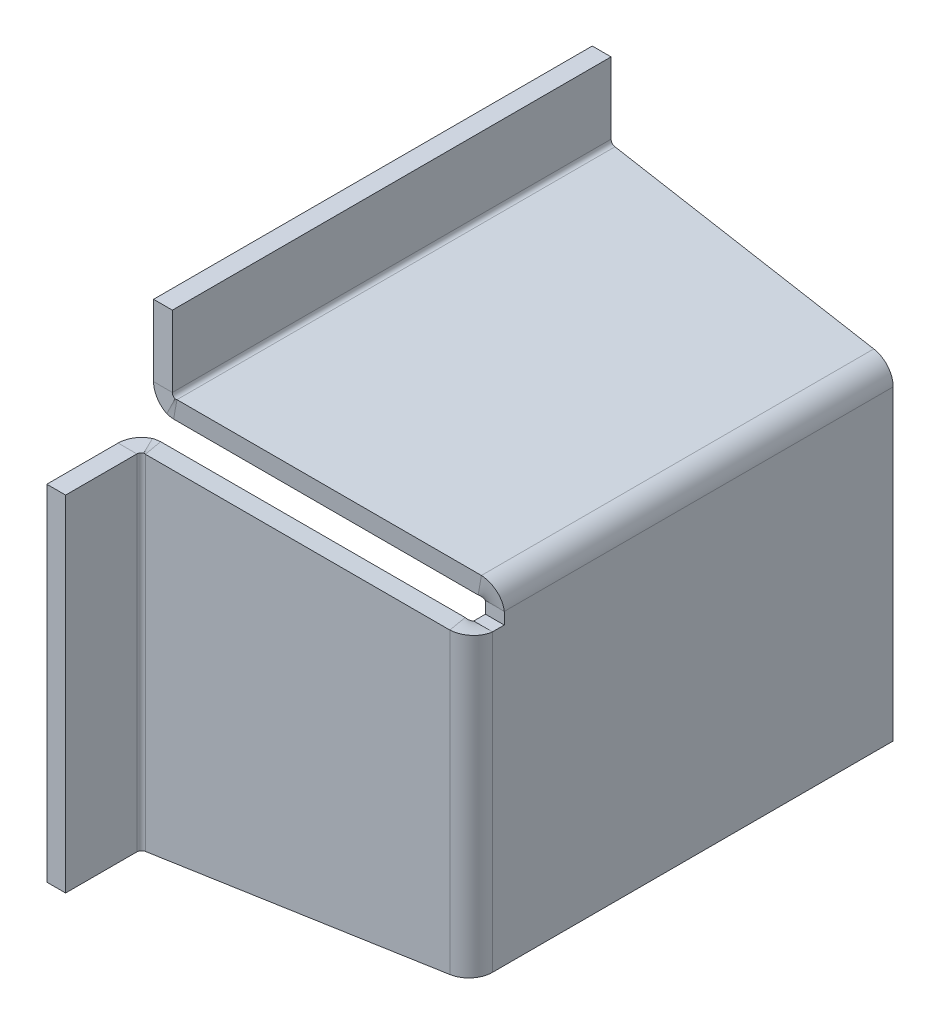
ISO-10303-21;
HEADER;
FILE_DESCRIPTION(('STEP AP214'),'2;1');
FILE_NAME('part.step','',(''),(''),'','','');
FILE_SCHEMA(('AUTOMOTIVE_DESIGN { 1 0 10303 214 1 1 1 1 }'));
ENDSEC;
DATA;
#1=APPLICATION_CONTEXT('core data for automotive mechanical design processes');
#2=APPLICATION_PROTOCOL_DEFINITION('international standard','automotive_design',2000,#1);
#3=PRODUCT_CONTEXT('',#1,'mechanical');
#4=PRODUCT('Part','Part','',(#3));
#5=PRODUCT_RELATED_PRODUCT_CATEGORY('part','',(#4));
#6=PRODUCT_DEFINITION_FORMATION('','',#4);
#7=PRODUCT_DEFINITION_CONTEXT('part definition',#1,'design');
#8=PRODUCT_DEFINITION('design','',#6,#7);
#9=PRODUCT_DEFINITION_SHAPE('','',#8);
#10=(LENGTH_UNIT() NAMED_UNIT(*) SI_UNIT(.MILLI.,.METRE.));
#11=(NAMED_UNIT(*) PLANE_ANGLE_UNIT() SI_UNIT($,.RADIAN.));
#12=(NAMED_UNIT(*) SI_UNIT($,.STERADIAN.) SOLID_ANGLE_UNIT());
#13=UNCERTAINTY_MEASURE_WITH_UNIT(LENGTH_MEASURE(1.E-05),#10,'distance_accuracy_value','');
#14=(GEOMETRIC_REPRESENTATION_CONTEXT(3) GLOBAL_UNCERTAINTY_ASSIGNED_CONTEXT((#13)) GLOBAL_UNIT_ASSIGNED_CONTEXT((#10,
#11,#12)) REPRESENTATION_CONTEXT('',''));
#15=CARTESIAN_POINT('',(0.,0.,0.));
#16=DIRECTION('',(0.,0.,1.));
#17=DIRECTION('',(1.,0.,0.));
#18=AXIS2_PLACEMENT_3D('',#15,#16,#17);
#19=CARTESIAN_POINT('',(925.185297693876,480.,580.));
#20=DIRECTION('',(0.,1.,0.));
#21=DIRECTION('',(0.,0.,1.));
#22=AXIS2_PLACEMENT_3D('',#19,#20,#21);
#23=PLANE('',#22);
#24=DIRECTION('',(0.,0.,-1.));
#25=VECTOR('',#24,1.);
#26=CARTESIAN_POINT('',(-20.0000000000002,480.,580.));
#27=LINE('',#26,#25);
#28=CARTESIAN_POINT('',(-20.0000000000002,480.,466.47346038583));
#29=VERTEX_POINT('',#28);
#30=CARTESIAN_POINT('',(-20.0000000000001,480.,0.));
#31=VERTEX_POINT('',#30);
#32=EDGE_CURVE('E755',#29,#31,#27,.T.);
#33=ORIENTED_EDGE('',*,*,#32,.F.);
#34=DIRECTION('',(-1.,0.,0.));
#35=VECTOR('',#34,1.);
#36=CARTESIAN_POINT('',(925.185297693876,480.,466.473460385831));
#37=LINE('',#36,#35);
#38=CARTESIAN_POINT('',(-2.22044604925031E-13,480.,466.47346038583));
#39=VERTEX_POINT('',#38);
#40=EDGE_CURVE('E42',#39,#29,#37,.T.);
#41=ORIENTED_EDGE('',*,*,#40,.F.);
#42=DIRECTION('',(0.,0.,-1.));
#43=VECTOR('',#42,1.);
#44=CARTESIAN_POINT('',(-2.22044604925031E-13,480.,580.));
#45=LINE('',#44,#43);
#46=CARTESIAN_POINT('',(-1.11022302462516E-13,480.,0.));
#47=VERTEX_POINT('',#46);
#48=EDGE_CURVE('E50',#39,#47,#45,.T.);
#49=ORIENTED_EDGE('',*,*,#48,.T.);
#50=DIRECTION('',(-1.,0.,0.));
#51=VECTOR('',#50,1.);
#52=CARTESIAN_POINT('',(925.185297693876,480.,1.91402472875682E-13));
#53=LINE('',#52,#51);
#54=EDGE_CURVE('E767',#47,#31,#53,.T.);
#55=ORIENTED_EDGE('',*,*,#54,.T.);
#56=EDGE_LOOP('',(#33,#41,#49,#55));
#57=FACE_BOUND('',#56,.T.);
#58=ADVANCED_FACE('F32',(#57),#23,.T.);
#59=CARTESIAN_POINT('',(925.185297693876,-480.,3.03369937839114E-13));
#60=DIRECTION('',(0.,0.,1.));
#61=DIRECTION('',(1.,0.,0.));
#62=AXIS2_PLACEMENT_3D('',#59,#60,#61);
#63=PLANE('',#62);
#64=DIRECTION('',(-1.,0.,0.));
#65=VECTOR('',#64,1.);
#66=CARTESIAN_POINT('',(925.185297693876,404.195498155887,2.0024376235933E-13));
#67=LINE('',#66,#65);
#68=CARTESIAN_POINT('',(0.,404.195498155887,-1.12212319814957E-13));
#69=VERTEX_POINT('',#68);
#70=CARTESIAN_POINT('',(-19.9999999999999,404.195498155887,-1.16972389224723E-13));
#71=VERTEX_POINT('',#70);
#72=EDGE_CURVE('E765',#69,#71,#67,.T.);
#73=ORIENTED_EDGE('',*,*,#72,.T.);
#74=DIRECTION('',(0.,-1.,0.));
#75=VECTOR('',#74,1.);
#76=CARTESIAN_POINT('',(-20.,0.,0.));
#77=LINE('',#76,#75);
#78=EDGE_CURVE('E73',#31,#71,#77,.T.);
#79=ORIENTED_EDGE('',*,*,#78,.F.);
#80=ORIENTED_EDGE('',*,*,#54,.F.);
#81=DIRECTION('',(0.,1.,0.));
#82=VECTOR('',#81,1.);
#83=CARTESIAN_POINT('',(1.66533453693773E-13,-480.,-1.30383812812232E-13));
#84=LINE('',#83,#82);
#85=EDGE_CURVE('E12',#69,#47,#84,.T.);
#86=ORIENTED_EDGE('',*,*,#85,.F.);
#87=EDGE_LOOP('',(#73,#79,#80,#86));
#88=FACE_BOUND('',#87,.T.);
#89=ADVANCED_FACE('F782',(#88),#63,.F.);
#90=CARTESIAN_POINT('',(-19.9999999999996,-480.,-580.));
#91=DIRECTION('',(1.,0.,0.));
#92=DIRECTION('',(0.,0.,-1.));
#93=AXIS2_PLACEMENT_3D('',#90,#91,#92);
#94=PLANE('',#93);
#95=ORIENTED_EDGE('',*,*,#78,.T.);
#96=DIRECTION('',(0.,0.,1.));
#97=VECTOR('',#96,1.);
#98=CARTESIAN_POINT('',(-20.,404.195498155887,-1.29464265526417E-13));
#99=LINE('',#98,#97);
#100=CARTESIAN_POINT('',(-20.0000000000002,404.195498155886,466.47346038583));
#101=VERTEX_POINT('',#100);
#102=EDGE_CURVE('E761',#71,#101,#99,.T.);
#103=ORIENTED_EDGE('',*,*,#102,.T.);
#104=DIRECTION('',(0.,1.,0.));
#105=VECTOR('',#104,1.);
#106=CARTESIAN_POINT('',(-19.9999999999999,-480.,466.47346038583));
#107=LINE('',#106,#105);
#108=EDGE_CURVE('E758',#101,#29,#107,.T.);
#109=ORIENTED_EDGE('',*,*,#108,.T.);
#110=ORIENTED_EDGE('',*,*,#32,.T.);
#111=EDGE_LOOP('',(#95,#103,#109,#110));
#112=FACE_BOUND('',#111,.T.);
#113=ADVANCED_FACE('F774',(#112),#94,.F.);
#114=CARTESIAN_POINT('',(925.185297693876,-480.,466.473460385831));
#115=DIRECTION('',(0.,0.,1.));
#116=DIRECTION('',(1.,0.,0.));
#117=AXIS2_PLACEMENT_3D('',#114,#115,#116);
#118=PLANE('',#117);
#119=ORIENTED_EDGE('',*,*,#108,.F.);
#120=DIRECTION('',(-1.,0.,0.));
#121=VECTOR('',#120,1.);
#122=CARTESIAN_POINT('',(925.185297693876,404.195498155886,466.473460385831));
#123=LINE('',#122,#121);
#124=CARTESIAN_POINT('',(0.,404.195498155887,466.47346038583));
#125=VERTEX_POINT('',#124);
#126=EDGE_CURVE('E769',#125,#101,#123,.T.);
#127=ORIENTED_EDGE('',*,*,#126,.F.);
#128=DIRECTION('',(0.,1.,0.));
#129=VECTOR('',#128,1.);
#130=CARTESIAN_POINT('',(0.,-480.,466.47346038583));
#131=LINE('',#130,#129);
#132=EDGE_CURVE('E753',#125,#39,#131,.T.);
#133=ORIENTED_EDGE('',*,*,#132,.T.);
#134=ORIENTED_EDGE('',*,*,#40,.T.);
#135=EDGE_LOOP('',(#119,#127,#133,#134));
#136=FACE_BOUND('',#135,.T.);
#137=ADVANCED_FACE('F777',(#136),#118,.T.);
#138=CARTESIAN_POINT('',(3.33066907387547E-13,-480.,-580.));
#139=DIRECTION('',(1.,0.,0.));
#140=DIRECTION('',(0.,0.,-1.));
#141=AXIS2_PLACEMENT_3D('',#138,#139,#140);
#142=PLANE('',#141);
#143=DIRECTION('',(0.,0.,1.));
#144=VECTOR('',#143,1.);
#145=CARTESIAN_POINT('',(0.,404.195498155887,-1.22487685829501E-13));
#146=LINE('',#145,#144);
#147=EDGE_CURVE('E36',#69,#125,#146,.T.);
#148=ORIENTED_EDGE('',*,*,#147,.F.);
#149=ORIENTED_EDGE('',*,*,#85,.T.);
#150=ORIENTED_EDGE('',*,*,#48,.F.);
#151=ORIENTED_EDGE('',*,*,#132,.F.);
#152=EDGE_LOOP('',(#148,#149,#150,#151));
#153=FACE_BOUND('',#152,.T.);
#154=ADVANCED_FACE('F34',(#153),#142,.T.);
#155=CARTESIAN_POINT('',(-197.673013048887,-688.514182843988,467.454817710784));
#156=DIRECTION('',(0.168488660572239,-0.0297090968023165,0.985255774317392));
#157=DIRECTION('',(0.970287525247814,-0.171087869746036,-0.171087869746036));
#158=AXIS2_PLACEMENT_3D('',#155,#156,#157);
#159=PLANE('',#158);
#160=DIRECTION('',(-0.970287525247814,0.171087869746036,0.171087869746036));
#161=VECTOR('',#160,1.);
#162=CARTESIAN_POINT('',(-5.56555395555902,400.981357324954,467.454817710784));
#163=LINE('',#162,#161);
#164=CARTESIAN_POINT('',(4.13175911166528,399.271459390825,465.744919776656));
#165=VERTEX_POINT('',#164);
#166=CARTESIAN_POINT('',(279.341204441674,350.744608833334,417.218069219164));
#167=VERTEX_POINT('',#166);
#168=EDGE_CURVE('E710',#165,#167,#163,.F.);
#169=ORIENTED_EDGE('',*,*,#168,.F.);
#170=CARTESIAN_POINT('',(0.658795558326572,379.575304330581,465.744919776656));
#171=CARTESIAN_POINT('',(4.13175911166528,399.271459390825,465.744919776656));
#172=B_SPLINE_CURVE_WITH_KNOTS('',1,(#170,#171),.UNSPECIFIED.,.F.,.F.,(2,2),(0.,1.),.UNSPECIFIED.);
#173=CARTESIAN_POINT('',(0.658795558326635,379.575304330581,465.744919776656));
#174=VERTEX_POINT('',#173);
#175=EDGE_CURVE('E222',#174,#165,#172,.T.);
#176=ORIENTED_EDGE('',*,*,#175,.F.);
#177=DIRECTION('',(-0.970287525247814,0.171087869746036,0.171087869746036));
#178=VECTOR('',#177,1.);
#179=CARTESIAN_POINT('',(-9.03851750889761,381.28520226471,467.454817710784));
#180=LINE('',#179,#178);
#181=CARTESIAN_POINT('',(275.868240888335,331.04845377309,417.218069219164));
#182=VERTEX_POINT('',#181);
#183=EDGE_CURVE('E733',#174,#182,#180,.F.);
#184=ORIENTED_EDGE('',*,*,#183,.T.);
#185=CARTESIAN_POINT('',(279.341204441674,350.744608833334,417.218069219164));
#186=CARTESIAN_POINT('',(275.868240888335,331.04845377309,417.218069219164));
#187=B_SPLINE_CURVE_WITH_KNOTS('',1,(#185,#186),.UNSPECIFIED.,.F.,.F.,(2,2),(0.,1.),.UNSPECIFIED.);
#188=EDGE_CURVE('E349',#182,#167,#187,.F.);
#189=ORIENTED_EDGE('',*,*,#188,.T.);
#190=EDGE_LOOP('',(#169,#176,#184,#189));
#191=FACE_BOUND('',#190,.T.);
#192=ADVANCED_FACE('F671',(#191),#159,.T.);
#193=CARTESIAN_POINT('',(-2.22044604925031E-13,400.,500.));
#194=DIRECTION('',(0.173648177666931,0.984807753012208,0.));
#195=DIRECTION('',(-0.984807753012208,0.173648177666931,0.));
#196=AXIS2_PLACEMENT_3D('',#193,#194,#195);
#197=PLANE('',#196);
#198=DIRECTION('',(-0.984807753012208,0.173648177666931,0.));
#199=VECTOR('',#198,1.);
#200=CARTESIAN_POINT('',(0.,400.,-1.20237744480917E-13));
#201=LINE('',#200,#199);
#202=CARTESIAN_POINT('',(4.13175911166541,399.271459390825,-1.1876503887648E-13));
#203=VERTEX_POINT('',#202);
#204=CARTESIAN_POINT('',(279.341204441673,350.744608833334,-1.31692926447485E-13));
#205=VERTEX_POINT('',#204);
#206=EDGE_CURVE('E697',#203,#205,#201,.F.);
#207=ORIENTED_EDGE('',*,*,#206,.F.);
#208=DIRECTION('',(0.,0.,-1.));
#209=VECTOR('',#208,1.);
#210=CARTESIAN_POINT('',(4.13175911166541,399.271459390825,-1.1876503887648E-13));
#211=LINE('',#210,#209);
#212=EDGE_CURVE('E715',#203,#165,#211,.F.);
#213=ORIENTED_EDGE('',*,*,#212,.T.);
#214=ORIENTED_EDGE('',*,*,#168,.T.);
#215=DIRECTION('',(0.,0.,1.));
#216=VECTOR('',#215,1.);
#217=CARTESIAN_POINT('',(279.341204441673,350.744608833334,417.218069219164));
#218=LINE('',#217,#216);
#219=EDGE_CURVE('E703',#167,#205,#218,.F.);
#220=ORIENTED_EDGE('',*,*,#219,.T.);
#221=EDGE_LOOP('',(#207,#213,#214,#220));
#222=FACE_BOUND('',#221,.T.);
#223=ADVANCED_FACE('F788',(#222),#197,.T.);
#224=CARTESIAN_POINT('',(-192.107459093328,-689.495540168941,-2.88566559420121E-13));
#225=DIRECTION('',(0.,0.,1.));
#226=DIRECTION('',(0.984807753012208,-0.17364817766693,0.));
#227=AXIS2_PLACEMENT_3D('',#224,#225,#226);
#228=PLANE('',#227);
#229=DIRECTION('',(0.173648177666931,0.984807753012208,0.));
#230=VECTOR('',#229,1.);
#231=CARTESIAN_POINT('',(-187.975699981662,-690.224080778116,-2.87093853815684E-13));
#232=LINE('',#231,#230);
#233=CARTESIAN_POINT('',(0.65879555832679,379.575304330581,-1.12055524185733E-13));
#234=VERTEX_POINT('',#233);
#235=EDGE_CURVE('E700',#234,#203,#232,.T.);
#236=ORIENTED_EDGE('',*,*,#235,.T.);
#237=ORIENTED_EDGE('',*,*,#206,.T.);
#238=DIRECTION('',(0.173648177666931,0.984807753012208,0.));
#239=VECTOR('',#238,1.);
#240=CARTESIAN_POINT('',(87.2337453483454,-738.750931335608,-1.88999438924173E-13));
#241=LINE('',#240,#239);
#242=CARTESIAN_POINT('',(275.868240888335,331.04845377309,0.));
#243=VERTEX_POINT('',#242);
#244=EDGE_CURVE('E704',#243,#205,#241,.T.);
#245=ORIENTED_EDGE('',*,*,#244,.F.);
#246=DIRECTION('',(-0.984807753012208,0.173648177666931,0.));
#247=VECTOR('',#246,1.);
#248=CARTESIAN_POINT('',(-3.4729635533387,380.303844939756,-1.23280832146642E-13));
#249=LINE('',#248,#247);
#250=EDGE_CURVE('E694',#234,#243,#249,.F.);
#251=ORIENTED_EDGE('',*,*,#250,.F.);
#252=EDGE_LOOP('',(#236,#237,#245,#251));
#253=FACE_BOUND('',#252,.T.);
#254=ADVANCED_FACE('F826',(#253),#228,.F.);
#255=CARTESIAN_POINT('',(-3.47296355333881,380.303844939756,500.));
#256=DIRECTION('',(0.173648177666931,0.984807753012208,0.));
#257=DIRECTION('',(-0.984807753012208,0.173648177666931,0.));
#258=AXIS2_PLACEMENT_3D('',#255,#256,#257);
#259=PLANE('',#258);
#260=DIRECTION('',(0.,0.,-1.));
#261=VECTOR('',#260,1.);
#262=CARTESIAN_POINT('',(0.658795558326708,379.575304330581,-1.21808126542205E-13));
#263=LINE('',#262,#261);
#264=EDGE_CURVE('E707',#234,#174,#263,.F.);
#265=ORIENTED_EDGE('',*,*,#264,.F.);
#266=ORIENTED_EDGE('',*,*,#250,.T.);
#267=DIRECTION('',(0.,0.,1.));
#268=VECTOR('',#267,1.);
#269=CARTESIAN_POINT('',(275.868240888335,331.048453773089,417.218069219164));
#270=LINE('',#269,#268);
#271=EDGE_CURVE('E622',#182,#243,#270,.F.);
#272=ORIENTED_EDGE('',*,*,#271,.F.);
#273=ORIENTED_EDGE('',*,*,#183,.F.);
#274=EDGE_LOOP('',(#265,#266,#272,#273));
#275=FACE_BOUND('',#274,.T.);
#276=ADVANCED_FACE('F669',(#275),#259,.F.);
#277=CARTESIAN_POINT('',(-793.199238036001,-400.,413.575366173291));
#278=DIRECTION('',(0.,0.,-1.));
#279=DIRECTION('',(-1.,0.,0.));
#280=AXIS2_PLACEMENT_3D('',#277,#278,#279);
#281=PLANE('',#280);
#282=DIRECTION('',(0.,1.,0.));
#283=VECTOR('',#282,1.);
#284=CARTESIAN_POINT('',(300.,-400.,413.575366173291));
#285=LINE('',#284,#283);
#286=CARTESIAN_POINT('',(300.,313.575366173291,413.575366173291));
#287=VERTEX_POINT('',#286);
#288=CARTESIAN_POINT('',(300.,326.124415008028,413.575366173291));
#289=VERTEX_POINT('',#288);
#290=EDGE_CURVE('E597',#287,#289,#285,.T.);
#291=ORIENTED_EDGE('',*,*,#290,.T.);
#292=CARTESIAN_POINT('',(280.,326.124415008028,413.575366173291));
#293=CARTESIAN_POINT('',(300.,326.124415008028,413.575366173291));
#294=B_SPLINE_CURVE_WITH_KNOTS('',1,(#292,#293),.UNSPECIFIED.,.F.,.F.,(2,2),(0.,1.),.UNSPECIFIED.);
#295=CARTESIAN_POINT('',(280.,326.124415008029,413.575366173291));
#296=VERTEX_POINT('',#295);
#297=EDGE_CURVE('E619',#296,#289,#294,.T.);
#298=ORIENTED_EDGE('',*,*,#297,.F.);
#299=DIRECTION('',(0.,-1.,0.));
#300=VECTOR('',#299,1.);
#301=CARTESIAN_POINT('',(280.,-400.,413.575366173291));
#302=LINE('',#301,#300);
#303=CARTESIAN_POINT('',(280.,313.575366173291,413.575366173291));
#304=VERTEX_POINT('',#303);
#305=EDGE_CURVE('E631',#296,#304,#302,.T.);
#306=ORIENTED_EDGE('',*,*,#305,.T.);
#307=DIRECTION('',(1.,0.,0.));
#308=VECTOR('',#307,1.);
#309=CARTESIAN_POINT('',(-793.199238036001,313.575366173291,413.575366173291));
#310=LINE('',#309,#308);
#311=EDGE_CURVE('E606',#304,#287,#310,.T.);
#312=ORIENTED_EDGE('',*,*,#311,.T.);
#313=EDGE_LOOP('',(#291,#298,#306,#312));
#314=FACE_BOUND('',#313,.T.);
#315=ADVANCED_FACE('F664',(#314),#281,.F.);
#316=CARTESIAN_POINT('',(-793.199238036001,-400.,-2.22044604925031E-13));
#317=DIRECTION('',(0.,0.,-1.));
#318=DIRECTION('',(-1.,0.,0.));
#319=AXIS2_PLACEMENT_3D('',#316,#317,#318);
#320=PLANE('',#319);
#321=DIRECTION('',(1.,0.,0.));
#322=VECTOR('',#321,1.);
#323=CARTESIAN_POINT('',(-793.199238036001,326.124415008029,-1.11022302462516E-13));
#324=LINE('',#323,#322);
#325=CARTESIAN_POINT('',(280.,326.124415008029,0.));
#326=VERTEX_POINT('',#325);
#327=CARTESIAN_POINT('',(300.,326.124415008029,-1.11022302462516E-13));
#328=VERTEX_POINT('',#327);
#329=EDGE_CURVE('E616',#326,#328,#324,.T.);
#330=ORIENTED_EDGE('',*,*,#329,.T.);
#331=DIRECTION('',(0.,-1.,0.));
#332=VECTOR('',#331,1.);
#333=CARTESIAN_POINT('',(300.,1.6259377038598E-13,-1.11022302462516E-13));
#334=LINE('',#333,#332);
#335=CARTESIAN_POINT('',(300.,1.6259377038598E-13,-1.11022302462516E-13));
#336=VERTEX_POINT('',#335);
#337=EDGE_CURVE('E594',#328,#336,#334,.T.);
#338=ORIENTED_EDGE('',*,*,#337,.T.);
#339=DIRECTION('',(1.,0.,0.));
#340=VECTOR('',#339,1.);
#341=CARTESIAN_POINT('',(-793.199238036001,0.,-2.22044604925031E-13));
#342=LINE('',#341,#340);
#343=CARTESIAN_POINT('',(280.,1.59220545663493E-13,-1.11022302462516E-13));
#344=VERTEX_POINT('',#343);
#345=EDGE_CURVE('E613',#344,#336,#342,.T.);
#346=ORIENTED_EDGE('',*,*,#345,.F.);
#347=DIRECTION('',(0.,1.,0.));
#348=VECTOR('',#347,1.);
#349=CARTESIAN_POINT('',(280.,-400.,-2.22044604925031E-13));
#350=LINE('',#349,#348);
#351=EDGE_CURVE('E598',#344,#326,#350,.T.);
#352=ORIENTED_EDGE('',*,*,#351,.T.);
#353=EDGE_LOOP('',(#330,#338,#346,#352));
#354=FACE_BOUND('',#353,.T.);
#355=ADVANCED_FACE('F660',(#354),#320,.T.);
#356=CARTESIAN_POINT('',(-793.199238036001,0.,500.));
#357=DIRECTION('',(0.,-1.,0.));
#358=DIRECTION('',(0.,0.,-1.));
#359=AXIS2_PLACEMENT_3D('',#356,#357,#358);
#360=PLANE('',#359);
#361=ORIENTED_EDGE('',*,*,#345,.T.);
#362=DIRECTION('',(0.,0.,1.));
#363=VECTOR('',#362,1.);
#364=CARTESIAN_POINT('',(300.,1.6259377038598E-13,-1.11022302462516E-13));
#365=LINE('',#364,#363);
#366=CARTESIAN_POINT('',(300.,1.19152476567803E-13,426.124415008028));
#367=VERTEX_POINT('',#366);
#368=EDGE_CURVE('E592',#336,#367,#365,.T.);
#369=ORIENTED_EDGE('',*,*,#368,.T.);
#370=DIRECTION('',(1.,0.,0.));
#371=VECTOR('',#370,1.);
#372=CARTESIAN_POINT('',(-793.199238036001,0.,426.124415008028));
#373=LINE('',#372,#371);
#374=CARTESIAN_POINT('',(280.,1.15779251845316E-13,426.124415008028));
#375=VERTEX_POINT('',#374);
#376=EDGE_CURVE('E610',#375,#367,#373,.T.);
#377=ORIENTED_EDGE('',*,*,#376,.F.);
#378=DIRECTION('',(0.,0.,-1.));
#379=VECTOR('',#378,1.);
#380=CARTESIAN_POINT('',(280.,1.08247998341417E-13,500.));
#381=LINE('',#380,#379);
#382=EDGE_CURVE('E601',#375,#344,#381,.T.);
#383=ORIENTED_EDGE('',*,*,#382,.T.);
#384=EDGE_LOOP('',(#361,#369,#377,#383));
#385=FACE_BOUND('',#384,.T.);
#386=ADVANCED_FACE('F656',(#385),#360,.T.);
#387=CARTESIAN_POINT('',(-793.199238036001,313.575366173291,500.));
#388=DIRECTION('',(0.,-1.,0.));
#389=DIRECTION('',(0.,0.,-1.));
#390=AXIS2_PLACEMENT_3D('',#387,#388,#389);
#391=PLANE('',#390);
#392=DIRECTION('',(0.,0.,1.));
#393=VECTOR('',#392,1.);
#394=CARTESIAN_POINT('',(300.,313.575366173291,500.));
#395=LINE('',#394,#393);
#396=CARTESIAN_POINT('',(300.,313.575366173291,426.124415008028));
#397=VERTEX_POINT('',#396);
#398=EDGE_CURVE('E620',#287,#397,#395,.T.);
#399=ORIENTED_EDGE('',*,*,#398,.F.);
#400=ORIENTED_EDGE('',*,*,#311,.F.);
#401=DIRECTION('',(0.,0.,1.));
#402=VECTOR('',#401,1.);
#403=CARTESIAN_POINT('',(280.,313.575366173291,500.));
#404=LINE('',#403,#402);
#405=CARTESIAN_POINT('',(280.,313.575366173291,426.124415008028));
#406=VERTEX_POINT('',#405);
#407=EDGE_CURVE('E623',#304,#406,#404,.T.);
#408=ORIENTED_EDGE('',*,*,#407,.T.);
#409=CARTESIAN_POINT('',(300.,313.575366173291,426.124415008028));
#410=CARTESIAN_POINT('',(280.,313.575366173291,426.124415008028));
#411=B_SPLINE_CURVE_WITH_KNOTS('',1,(#409,#410),.UNSPECIFIED.,.F.,.F.,(2,2),(0.,1.),.UNSPECIFIED.);
#412=EDGE_CURVE('E444',#406,#397,#411,.F.);
#413=ORIENTED_EDGE('',*,*,#412,.T.);
#414=EDGE_LOOP('',(#399,#400,#408,#413));
#415=FACE_BOUND('',#414,.T.);
#416=ADVANCED_FACE('F645',(#415),#391,.F.);
#417=CARTESIAN_POINT('',(280.,-400.,500.));
#418=DIRECTION('',(1.,0.,0.));
#419=DIRECTION('',(0.,0.,-1.));
#420=AXIS2_PLACEMENT_3D('',#417,#418,#419);
#421=PLANE('',#420);
#422=DIRECTION('',(0.,0.,1.));
#423=VECTOR('',#422,1.);
#424=CARTESIAN_POINT('',(280.,326.124415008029,413.575366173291));
#425=LINE('',#424,#423);
#426=EDGE_CURVE('E609',#326,#296,#425,.T.);
#427=ORIENTED_EDGE('',*,*,#426,.F.);
#428=ORIENTED_EDGE('',*,*,#351,.F.);
#429=ORIENTED_EDGE('',*,*,#382,.F.);
#430=DIRECTION('',(0.,1.,0.));
#431=VECTOR('',#430,1.);
#432=CARTESIAN_POINT('',(280.,313.575366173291,426.124415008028));
#433=LINE('',#432,#431);
#434=EDGE_CURVE('E605',#375,#406,#433,.T.);
#435=ORIENTED_EDGE('',*,*,#434,.T.);
#436=ORIENTED_EDGE('',*,*,#407,.F.);
#437=ORIENTED_EDGE('',*,*,#305,.F.);
#438=EDGE_LOOP('',(#427,#428,#429,#435,#436,#437));
#439=FACE_BOUND('',#438,.T.);
#440=ADVANCED_FACE('F655',(#439),#421,.F.);
#441=CARTESIAN_POINT('',(300.,-400.,500.));
#442=DIRECTION('',(1.,0.,0.));
#443=DIRECTION('',(0.,0.,-1.));
#444=AXIS2_PLACEMENT_3D('',#441,#442,#443);
#445=PLANE('',#444);
#446=ORIENTED_EDGE('',*,*,#337,.F.);
#447=DIRECTION('',(0.,0.,1.));
#448=VECTOR('',#447,1.);
#449=CARTESIAN_POINT('',(300.,326.124415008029,413.575366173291));
#450=LINE('',#449,#448);
#451=EDGE_CURVE('E602',#328,#289,#450,.T.);
#452=ORIENTED_EDGE('',*,*,#451,.T.);
#453=ORIENTED_EDGE('',*,*,#290,.F.);
#454=ORIENTED_EDGE('',*,*,#398,.T.);
#455=DIRECTION('',(0.,1.,0.));
#456=VECTOR('',#455,1.);
#457=CARTESIAN_POINT('',(300.,313.575366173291,426.124415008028));
#458=LINE('',#457,#456);
#459=EDGE_CURVE('E626',#367,#397,#458,.T.);
#460=ORIENTED_EDGE('',*,*,#459,.F.);
#461=ORIENTED_EDGE('',*,*,#368,.F.);
#462=EDGE_LOOP('',(#446,#452,#453,#454,#460,#461));
#463=FACE_BOUND('',#462,.T.);
#464=ADVANCED_FACE('F875',(#463),#445,.T.);
#465=CARTESIAN_POINT('',(728.46274367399,-480.,580.));
#466=DIRECTION('',(0.,0.,1.));
#467=DIRECTION('',(1.,0.,0.));
#468=AXIS2_PLACEMENT_3D('',#465,#466,#467);
#469=PLANE('',#468);
#470=DIRECTION('',(0.,1.,0.));
#471=VECTOR('',#470,1.);
#472=CARTESIAN_POINT('',(-20.,-480.,580.));
#473=LINE('',#472,#471);
#474=CARTESIAN_POINT('',(-20.,0.,580.));
#475=VERTEX_POINT('',#474);
#476=CARTESIAN_POINT('',(-20.,366.473460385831,580.));
#477=VERTEX_POINT('',#476);
#478=EDGE_CURVE('E1150',#475,#477,#473,.T.);
#479=ORIENTED_EDGE('',*,*,#478,.F.);
#480=DIRECTION('',(-1.,0.,0.));
#481=VECTOR('',#480,1.);
#482=CARTESIAN_POINT('',(728.46274367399,0.,580.));
#483=LINE('',#482,#481);
#484=CARTESIAN_POINT('',(0.,0.,580.));
#485=VERTEX_POINT('',#484);
#486=EDGE_CURVE('E1156',#485,#475,#483,.T.);
#487=ORIENTED_EDGE('',*,*,#486,.F.);
#488=DIRECTION('',(0.,1.,0.));
#489=VECTOR('',#488,1.);
#490=CARTESIAN_POINT('',(0.,-480.,580.));
#491=LINE('',#490,#489);
#492=CARTESIAN_POINT('',(0.,366.473460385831,580.));
#493=VERTEX_POINT('',#492);
#494=EDGE_CURVE('E1167',#485,#493,#491,.T.);
#495=ORIENTED_EDGE('',*,*,#494,.T.);
#496=DIRECTION('',(-1.,0.,0.));
#497=VECTOR('',#496,1.);
#498=CARTESIAN_POINT('',(728.46274367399,366.473460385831,580.));
#499=LINE('',#498,#497);
#500=EDGE_CURVE('E1165',#493,#477,#499,.T.);
#501=ORIENTED_EDGE('',*,*,#500,.T.);
#502=EDGE_LOOP('',(#479,#487,#495,#501));
#503=FACE_BOUND('',#502,.T.);
#504=ADVANCED_FACE('F420',(#503),#469,.T.);
#505=CARTESIAN_POINT('',(728.46274367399,366.47346038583,-580.));
#506=DIRECTION('',(0.,1.,0.));
#507=DIRECTION('',(0.,0.,1.));
#508=AXIS2_PLACEMENT_3D('',#505,#506,#507);
#509=PLANE('',#508);
#510=DIRECTION('',(0.,0.,-1.));
#511=VECTOR('',#510,1.);
#512=CARTESIAN_POINT('',(-20.,366.47346038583,-580.));
#513=LINE('',#512,#511);
#514=CARTESIAN_POINT('',(-20.,366.473460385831,504.195498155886));
#515=VERTEX_POINT('',#514);
#516=EDGE_CURVE('E1147',#477,#515,#513,.T.);
#517=ORIENTED_EDGE('',*,*,#516,.F.);
#518=ORIENTED_EDGE('',*,*,#500,.F.);
#519=DIRECTION('',(0.,0.,-1.));
#520=VECTOR('',#519,1.);
#521=CARTESIAN_POINT('',(0.,366.47346038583,-580.));
#522=LINE('',#521,#520);
#523=CARTESIAN_POINT('',(0.,366.473460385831,504.195498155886));
#524=VERTEX_POINT('',#523);
#525=EDGE_CURVE('E1162',#493,#524,#522,.T.);
#526=ORIENTED_EDGE('',*,*,#525,.T.);
#527=DIRECTION('',(-1.,0.,0.));
#528=VECTOR('',#527,1.);
#529=CARTESIAN_POINT('',(728.46274367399,366.473460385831,504.195498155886));
#530=LINE('',#529,#528);
#531=EDGE_CURVE('E1159',#524,#515,#530,.T.);
#532=ORIENTED_EDGE('',*,*,#531,.T.);
#533=EDGE_LOOP('',(#517,#518,#526,#532));
#534=FACE_BOUND('',#533,.T.);
#535=ADVANCED_FACE('F892',(#534),#509,.T.);
#536=CARTESIAN_POINT('',(728.46274367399,0.,-580.));
#537=DIRECTION('',(0.,1.,0.));
#538=DIRECTION('',(0.,0.,1.));
#539=AXIS2_PLACEMENT_3D('',#536,#537,#538);
#540=PLANE('',#539);
#541=ORIENTED_EDGE('',*,*,#486,.T.);
#542=DIRECTION('',(0.,0.,1.));
#543=VECTOR('',#542,1.);
#544=CARTESIAN_POINT('',(-20.,0.,0.));
#545=LINE('',#544,#543);
#546=CARTESIAN_POINT('',(-19.9999999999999,0.,504.195498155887));
#547=VERTEX_POINT('',#546);
#548=EDGE_CURVE('E1153',#547,#475,#545,.T.);
#549=ORIENTED_EDGE('',*,*,#548,.F.);
#550=DIRECTION('',(-1.,0.,0.));
#551=VECTOR('',#550,1.);
#552=CARTESIAN_POINT('',(728.46274367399,0.,504.195498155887));
#553=LINE('',#552,#551);
#554=CARTESIAN_POINT('',(0.,0.,504.195498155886));
#555=VERTEX_POINT('',#554);
#556=EDGE_CURVE('E1133',#555,#547,#553,.T.);
#557=ORIENTED_EDGE('',*,*,#556,.F.);
#558=DIRECTION('',(0.,0.,-1.));
#559=VECTOR('',#558,1.);
#560=CARTESIAN_POINT('',(0.,0.,-580.));
#561=LINE('',#560,#559);
#562=EDGE_CURVE('E1144',#485,#555,#561,.T.);
#563=ORIENTED_EDGE('',*,*,#562,.F.);
#564=EDGE_LOOP('',(#541,#549,#557,#563));
#565=FACE_BOUND('',#564,.T.);
#566=ADVANCED_FACE('F901',(#565),#540,.F.);
#567=CARTESIAN_POINT('',(-20.,-480.,-580.));
#568=DIRECTION('',(1.,0.,0.));
#569=DIRECTION('',(0.,0.,-1.));
#570=AXIS2_PLACEMENT_3D('',#567,#568,#569);
#571=PLANE('',#570);
#572=DIRECTION('',(0.,1.,0.));
#573=VECTOR('',#572,1.);
#574=CARTESIAN_POINT('',(-20.,0.,504.195498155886));
#575=LINE('',#574,#573);
#576=EDGE_CURVE('E1125',#547,#515,#575,.T.);
#577=ORIENTED_EDGE('',*,*,#576,.F.);
#578=ORIENTED_EDGE('',*,*,#548,.T.);
#579=ORIENTED_EDGE('',*,*,#478,.T.);
#580=ORIENTED_EDGE('',*,*,#516,.T.);
#581=EDGE_LOOP('',(#577,#578,#579,#580));
#582=FACE_BOUND('',#581,.T.);
#583=ADVANCED_FACE('F910',(#582),#571,.F.);
#584=CARTESIAN_POINT('',(0.,-480.,-580.));
#585=DIRECTION('',(1.,0.,0.));
#586=DIRECTION('',(0.,0.,-1.));
#587=AXIS2_PLACEMENT_3D('',#584,#585,#586);
#588=PLANE('',#587);
#589=ORIENTED_EDGE('',*,*,#562,.T.);
#590=DIRECTION('',(0.,1.,0.));
#591=VECTOR('',#590,1.);
#592=CARTESIAN_POINT('',(0.,0.,504.195498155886));
#593=LINE('',#592,#591);
#594=EDGE_CURVE('E1139',#555,#524,#593,.T.);
#595=ORIENTED_EDGE('',*,*,#594,.T.);
#596=ORIENTED_EDGE('',*,*,#525,.F.);
#597=ORIENTED_EDGE('',*,*,#494,.F.);
#598=EDGE_LOOP('',(#589,#595,#596,#597));
#599=FACE_BOUND('',#598,.T.);
#600=ADVANCED_FACE('F475',(#599),#588,.T.);
#601=CARTESIAN_POINT('',(5.,366.473460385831,504.195498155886));
#602=DIRECTION('',(0.,1.,0.));
#603=DIRECTION('',(-1.,0.,0.));
#604=AXIS2_PLACEMENT_3D('',#601,#602,#603);
#605=PLANE('',#604);
#606=ORIENTED_EDGE('',*,*,#531,.F.);
#607=CARTESIAN_POINT('',(5.,366.473460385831,504.195498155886));
#608=DIRECTION('',(0.,1.,0.));
#609=DIRECTION('',(0.,0.,1.));
#610=AXIS2_PLACEMENT_3D('',#607,#608,#609);
#611=CIRCLE('',#610,4.99999999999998);
#612=CARTESIAN_POINT('',(2.8061347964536,366.473460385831,499.70250856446));
#613=VERTEX_POINT('',#612);
#614=EDGE_CURVE('E1137',#524,#613,#611,.F.);
#615=ORIENTED_EDGE('',*,*,#614,.T.);
#616=CARTESIAN_POINT('',(-5.96932601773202,366.473460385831,481.730550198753));
#617=CARTESIAN_POINT('',(2.8061347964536,366.473460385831,499.70250856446));
#618=B_SPLINE_CURVE_WITH_KNOTS('',1,(#616,#617),.UNSPECIFIED.,.F.,.F.,(2,2),(0.,1.),.UNSPECIFIED.);
#619=CARTESIAN_POINT('',(-5.96932601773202,366.473460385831,481.730550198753));
#620=VERTEX_POINT('',#619);
#621=EDGE_CURVE('E456',#613,#620,#618,.F.);
#622=ORIENTED_EDGE('',*,*,#621,.T.);
#623=CARTESIAN_POINT('',(5.,366.473460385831,504.195498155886));
#624=DIRECTION('',(0.,1.,0.));
#625=DIRECTION('',(0.,0.,1.));
#626=AXIS2_PLACEMENT_3D('',#623,#624,#625);
#627=CIRCLE('',#626,25.);
#628=EDGE_CURVE('E1123',#515,#620,#627,.F.);
#629=ORIENTED_EDGE('',*,*,#628,.F.);
#630=EDGE_LOOP('',(#606,#615,#622,#629));
#631=FACE_BOUND('',#630,.T.);
#632=ADVANCED_FACE('F464',(#631),#605,.T.);
#633=CARTESIAN_POINT('',(5.00000000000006,0.,504.195498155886));
#634=DIRECTION('',(0.,-1.,0.));
#635=DIRECTION('',(1.,0.,0.));
#636=AXIS2_PLACEMENT_3D('',#633,#634,#635);
#637=PLANE('',#636);
#638=DIRECTION('',(-0.173648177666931,0.,-0.984807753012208));
#639=VECTOR('',#638,1.);
#640=CARTESIAN_POINT('',(160.514913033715,0.,1386.16439712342));
#641=LINE('',#640,#639);
#642=CARTESIAN_POINT('',(4.13175911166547,0.,499.271459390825));
#643=VERTEX_POINT('',#642);
#644=CARTESIAN_POINT('',(0.658795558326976,0.,479.575304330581));
#645=VERTEX_POINT('',#644);
#646=EDGE_CURVE('E1180',#643,#645,#641,.T.);
#647=ORIENTED_EDGE('',*,*,#646,.F.);
#648=CARTESIAN_POINT('',(5.00000000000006,0.,504.195498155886));
#649=DIRECTION('',(0.,1.,0.));
#650=DIRECTION('',(0.,0.,1.));
#651=AXIS2_PLACEMENT_3D('',#648,#649,#650);
#652=CIRCLE('',#651,4.99999999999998);
#653=EDGE_CURVE('E1135',#643,#555,#652,.T.);
#654=ORIENTED_EDGE('',*,*,#653,.T.);
#655=ORIENTED_EDGE('',*,*,#556,.T.);
#656=CARTESIAN_POINT('',(5.00000000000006,0.,504.195498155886));
#657=DIRECTION('',(0.,1.,0.));
#658=DIRECTION('',(0.,0.,1.));
#659=AXIS2_PLACEMENT_3D('',#656,#657,#658);
#660=CIRCLE('',#659,25.);
#661=EDGE_CURVE('E1130',#645,#547,#660,.T.);
#662=ORIENTED_EDGE('',*,*,#661,.F.);
#663=EDGE_LOOP('',(#647,#654,#655,#662));
#664=FACE_BOUND('',#663,.T.);
#665=ADVANCED_FACE('F474',(#664),#637,.T.);
#666=CARTESIAN_POINT('',(5.00000000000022,-1096.03767964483,504.195498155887));
#667=DIRECTION('',(0.,1.,0.));
#668=DIRECTION('',(0.,0.,1.));
#669=AXIS2_PLACEMENT_3D('',#666,#667,#668);
#670=CYLINDRICAL_SURFACE('',#669,25.);
#671=ORIENTED_EDGE('',*,*,#661,.T.);
#672=ORIENTED_EDGE('',*,*,#576,.T.);
#673=ORIENTED_EDGE('',*,*,#628,.T.);
#674=CARTESIAN_POINT('',(0.658795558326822,365.744919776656,479.575304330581));
#675=CARTESIAN_POINT('',(-1.63700708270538,365.987806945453,479.980116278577));
#676=CARTESIAN_POINT('',(-3.87449738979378,366.230573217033,480.707674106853));
#677=CARTESIAN_POINT('',(-5.96932601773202,366.473460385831,481.730550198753));
#678=B_SPLINE_CURVE_WITH_KNOTS('',3,(#674,#675,#676,#677),.UNSPECIFIED.,.F.,.F.,(4,4),(0.,1.),.UNSPECIFIED.);
#679=CARTESIAN_POINT('',(0.658795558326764,365.744919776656,479.575304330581));
#680=VERTEX_POINT('',#679);
#681=EDGE_CURVE('E533',#620,#680,#678,.F.);
#682=ORIENTED_EDGE('',*,*,#681,.T.);
#683=DIRECTION('',(0.,1.,0.));
#684=VECTOR('',#683,1.);
#685=CARTESIAN_POINT('',(0.658795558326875,0.,479.575304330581));
#686=LINE('',#685,#684);
#687=EDGE_CURVE('E1118',#680,#645,#686,.F.);
#688=ORIENTED_EDGE('',*,*,#687,.T.);
#689=EDGE_LOOP('',(#671,#672,#673,#682,#688));
#690=FACE_BOUND('',#689,.T.);
#691=ADVANCED_FACE('F479',(#690),#670,.T.);
#692=CARTESIAN_POINT('',(-5.96932601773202,366.473460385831,481.730550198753));
#693=CARTESIAN_POINT('',(-3.87449738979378,366.230573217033,480.707674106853));
#694=CARTESIAN_POINT('',(-1.63700708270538,365.987806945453,479.980116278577));
#695=CARTESIAN_POINT('',(0.658795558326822,365.744919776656,479.575304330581));
#696=CARTESIAN_POINT('',(2.8061347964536,366.473460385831,499.70250856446));
#697=CARTESIAN_POINT('',(3.22508748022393,366.230580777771,499.49793971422));
#698=CARTESIAN_POINT('',(3.67261287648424,365.987799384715,499.352419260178));
#699=CARTESIAN_POINT('',(4.13175911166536,365.744919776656,499.271459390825));
#700=B_SPLINE_SURFACE_WITH_KNOTS('',1,3,((#692,#693,#694,#695),(#696,#697,#698,#699)),
.UNSPECIFIED.,.F.,.F.,.F.,(2,2),(4,4),(0.,1.),(0.,1.),.UNSPECIFIED.);
#701=CARTESIAN_POINT('',(2.8061347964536,366.473460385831,499.70250856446));
#702=CARTESIAN_POINT('',(3.22508748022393,366.230580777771,499.49793971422));
#703=CARTESIAN_POINT('',(3.67261287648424,365.987799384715,499.352419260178));
#704=CARTESIAN_POINT('',(4.13175911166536,365.744919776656,499.271459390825));
#705=B_SPLINE_CURVE_WITH_KNOTS('',3,(#701,#702,#703,#704),.UNSPECIFIED.,.F.,.F.,(4,4),(0.,1.),.UNSPECIFIED.);
#706=CARTESIAN_POINT('',(4.13175911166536,365.744919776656,499.271459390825));
#707=VERTEX_POINT('',#706);
#708=EDGE_CURVE('E513',#613,#707,#705,.T.);
#709=CARTESIAN_POINT('',(4.13175911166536,365.744919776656,499.271459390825));
#710=CARTESIAN_POINT('',(0.658795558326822,365.744919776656,479.575304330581));
#711=B_SPLINE_CURVE_WITH_KNOTS('',1,(#709,#710),.UNSPECIFIED.,.F.,.F.,(2,2),(0.,1.),.UNSPECIFIED.);
#712=EDGE_CURVE('E523',#707,#680,#711,.T.);
#713=ORIENTED_EDGE('',*,*,#621,.F.);
#714=ORIENTED_EDGE('',*,*,#708,.T.);
#715=ORIENTED_EDGE('',*,*,#712,.T.);
#716=ORIENTED_EDGE('',*,*,#681,.F.);
#717=EDGE_LOOP('',(#713,#714,#715,#716));
#718=FACE_BOUND('',#717,.T.);
#719=ADVANCED_FACE('F484',(#718),#700,.T.);
#720=CARTESIAN_POINT('',(5.00000000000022,-1096.03767964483,504.195498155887));
#721=DIRECTION('',(0.,1.,0.));
#722=DIRECTION('',(0.,0.,1.));
#723=AXIS2_PLACEMENT_3D('',#720,#721,#722);
#724=CYLINDRICAL_SURFACE('',#723,4.99999999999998);
#725=ORIENTED_EDGE('',*,*,#653,.F.);
#726=DIRECTION('',(0.,1.,0.));
#727=VECTOR('',#726,1.);
#728=CARTESIAN_POINT('',(4.13175911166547,0.,499.271459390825));
#729=LINE('',#728,#727);
#730=EDGE_CURVE('E1111',#707,#643,#729,.F.);
#731=ORIENTED_EDGE('',*,*,#730,.F.);
#732=ORIENTED_EDGE('',*,*,#708,.F.);
#733=ORIENTED_EDGE('',*,*,#614,.F.);
#734=ORIENTED_EDGE('',*,*,#594,.F.);
#735=EDGE_LOOP('',(#725,#731,#732,#733,#734));
#736=FACE_BOUND('',#735,.T.);
#737=ADVANCED_FACE('F549',(#736),#724,.F.);
#738=CARTESIAN_POINT('',(0.,400.,500.));
#739=DIRECTION('',(0.173648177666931,0.,0.984807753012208));
#740=DIRECTION('',(0.984807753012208,0.,-0.173648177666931));
#741=AXIS2_PLACEMENT_3D('',#738,#739,#740);
#742=PLANE('',#741);
#743=DIRECTION('',(-0.984807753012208,0.,0.173648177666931));
#744=VECTOR('',#743,1.);
#745=CARTESIAN_POINT('',(1.66533453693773E-13,0.,500.));
#746=LINE('',#745,#744);
#747=CARTESIAN_POINT('',(279.341204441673,0.,450.744608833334));
#748=VERTEX_POINT('',#747);
#749=EDGE_CURVE('E589',#643,#748,#746,.F.);
#750=ORIENTED_EDGE('',*,*,#749,.T.);
#751=DIRECTION('',(0.,-1.,0.));
#752=VECTOR('',#751,1.);
#753=CARTESIAN_POINT('',(279.341204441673,317.218069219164,450.744608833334));
#754=LINE('',#753,#752);
#755=CARTESIAN_POINT('',(279.341204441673,317.218069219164,450.744608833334));
#756=VERTEX_POINT('',#755);
#757=EDGE_CURVE('E580',#748,#756,#754,.F.);
#758=ORIENTED_EDGE('',*,*,#757,.T.);
#759=DIRECTION('',(0.970287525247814,-0.171087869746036,-0.171087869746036));
#760=VECTOR('',#759,1.);
#761=CARTESIAN_POINT('',(-5.5655539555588,367.454817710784,500.981357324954));
#762=LINE('',#761,#760);
#763=EDGE_CURVE('E588',#756,#707,#762,.F.);
#764=ORIENTED_EDGE('',*,*,#763,.T.);
#765=ORIENTED_EDGE('',*,*,#730,.T.);
#766=EDGE_LOOP('',(#750,#758,#764,#765));
#767=FACE_BOUND('',#766,.T.);
#768=ADVANCED_FACE('F558',(#767),#742,.T.);
#769=CARTESIAN_POINT('',(150.817599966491,367.454817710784,1387.87429505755));
#770=DIRECTION('',(-0.168488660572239,-0.985255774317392,0.0297090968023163));
#771=DIRECTION('',(0.970287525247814,-0.171087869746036,-0.171087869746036));
#772=AXIS2_PLACEMENT_3D('',#769,#770,#771);
#773=PLANE('',#772);
#774=DIRECTION('',(-0.970287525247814,0.171087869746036,0.171087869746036));
#775=VECTOR('',#774,1.);
#776=CARTESIAN_POINT('',(-9.03851750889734,367.454817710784,481.28520226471));
#777=LINE('',#776,#775);
#778=CARTESIAN_POINT('',(275.868240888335,317.218069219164,431.04845377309));
#779=VERTEX_POINT('',#778);
#780=EDGE_CURVE('E1179',#680,#779,#777,.F.);
#781=ORIENTED_EDGE('',*,*,#780,.F.);
#782=ORIENTED_EDGE('',*,*,#712,.F.);
#783=ORIENTED_EDGE('',*,*,#763,.F.);
#784=CARTESIAN_POINT('',(275.868240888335,317.218069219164,431.04845377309));
#785=CARTESIAN_POINT('',(279.341204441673,317.218069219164,450.744608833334));
#786=B_SPLINE_CURVE_WITH_KNOTS('',1,(#784,#785),.UNSPECIFIED.,.F.,.F.,(2,2),(0.,1.),.UNSPECIFIED.);
#787=EDGE_CURVE('E1181',#756,#779,#786,.F.);
#788=ORIENTED_EDGE('',*,*,#787,.T.);
#789=EDGE_LOOP('',(#781,#782,#783,#788));
#790=FACE_BOUND('',#789,.T.);
#791=ADVANCED_FACE('F561',(#790),#773,.F.);
#792=CARTESIAN_POINT('',(-3.47296355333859,400.,480.303844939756));
#793=DIRECTION('',(0.173648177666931,0.,0.984807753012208));
#794=DIRECTION('',(0.984807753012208,0.,-0.173648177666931));
#795=AXIS2_PLACEMENT_3D('',#792,#793,#794);
#796=PLANE('',#795);
#797=DIRECTION('',(0.,-1.,0.));
#798=VECTOR('',#797,1.);
#799=CARTESIAN_POINT('',(275.868240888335,317.218069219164,431.04845377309));
#800=LINE('',#799,#798);
#801=CARTESIAN_POINT('',(275.868240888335,0.,431.04845377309));
#802=VERTEX_POINT('',#801);
#803=EDGE_CURVE('E1170',#802,#779,#800,.F.);
#804=ORIENTED_EDGE('',*,*,#803,.F.);
#805=DIRECTION('',(-0.984807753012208,0.,0.173648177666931));
#806=VECTOR('',#805,1.);
#807=CARTESIAN_POINT('',(-3.47296355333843,0.,480.303844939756));
#808=LINE('',#807,#806);
#809=EDGE_CURVE('E595',#645,#802,#808,.F.);
#810=ORIENTED_EDGE('',*,*,#809,.F.);
#811=ORIENTED_EDGE('',*,*,#687,.F.);
#812=ORIENTED_EDGE('',*,*,#780,.T.);
#813=EDGE_LOOP('',(#804,#810,#811,#812));
#814=FACE_BOUND('',#813,.T.);
#815=ADVANCED_FACE('F566',(#814),#796,.F.);
#816=CARTESIAN_POINT('',(156.38315392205,0.,1386.8929377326));
#817=DIRECTION('',(0.,-1.,0.));
#818=DIRECTION('',(0.984807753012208,0.,-0.173648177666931));
#819=AXIS2_PLACEMENT_3D('',#816,#817,#818);
#820=PLANE('',#819);
#821=ORIENTED_EDGE('',*,*,#646,.T.);
#822=ORIENTED_EDGE('',*,*,#809,.T.);
#823=DIRECTION('',(-0.173648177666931,0.,-0.984807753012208));
#824=VECTOR('',#823,1.);
#825=CARTESIAN_POINT('',(435.724358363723,1.01334600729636E-13,1337.63754656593));
#826=LINE('',#825,#824);
#827=EDGE_CURVE('E1171',#748,#802,#826,.T.);
#828=ORIENTED_EDGE('',*,*,#827,.F.);
#829=ORIENTED_EDGE('',*,*,#749,.F.);
#830=EDGE_LOOP('',(#821,#822,#828,#829));
#831=FACE_BOUND('',#830,.T.);
#832=ADVANCED_FACE('F419',(#831),#820,.T.);
#833=CARTESIAN_POINT('',(279.341204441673,317.218069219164,450.744608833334));
#834=CARTESIAN_POINT('',(282.206213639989,316.914476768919,450.239430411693));
#835=CARTESIAN_POINT('',(284.980834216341,316.610952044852,449.229491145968));
#836=CARTESIAN_POINT('',(290.019165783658,316.00383487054,446.320609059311));
#837=CARTESIAN_POINT('',(292.281317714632,315.700276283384,444.422438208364));
#838=CARTESIAN_POINT('',(296.020904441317,315.093159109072,439.96577229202));
#839=CARTESIAN_POINT('',(297.497419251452,314.789600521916,437.408373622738));
#840=CARTESIAN_POINT('',(299.487211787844,314.182483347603,431.941463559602));
#841=CARTESIAN_POINT('',(300.,313.878958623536,429.033621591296));
#842=CARTESIAN_POINT('',(300.,313.575366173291,426.124415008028));
#843=CARTESIAN_POINT('',(275.868240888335,317.218069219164,431.04845377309));
#844=CARTESIAN_POINT('',(276.441229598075,316.914483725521,430.947420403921));
#845=CARTESIAN_POINT('',(276.996166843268,316.610952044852,430.745430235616));
#846=CARTESIAN_POINT('',(278.003833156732,316.00383487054,430.163653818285));
#847=CARTESIAN_POINT('',(278.456263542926,315.700276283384,429.784019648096));
#848=CARTESIAN_POINT('',(279.204180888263,315.093159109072,428.892686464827));
#849=CARTESIAN_POINT('',(279.49948385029,314.789600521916,428.38120673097));
#850=CARTESIAN_POINT('',(279.897442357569,314.182483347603,427.287824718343));
#851=CARTESIAN_POINT('',(280.,313.878951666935,426.706242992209));
#852=CARTESIAN_POINT('',(280.,313.575366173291,426.124415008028));
#853=B_SPLINE_SURFACE_WITH_KNOTS('',1,3,((#833,#834,#835,#836,#837,#838,#839,#840,#841,#842),
(#843,#844,#845,#846,#847,#848,#849,#850,#851,#852)),.UNSPECIFIED.,.F.,.F.,.F.,(2,2),(4,2,2,2,
4),(0.,1.),(0.,0.25,0.5,0.75,1.),.UNSPECIFIED.);
#854=CARTESIAN_POINT('',(280.,313.575366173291,426.124415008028));
#855=CARTESIAN_POINT('',(280.,313.878951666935,426.706242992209));
#856=CARTESIAN_POINT('',(279.897442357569,314.182483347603,427.287824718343));
#857=CARTESIAN_POINT('',(279.49948385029,314.789600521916,428.38120673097));
#858=CARTESIAN_POINT('',(279.204180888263,315.093159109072,428.892686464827));
#859=CARTESIAN_POINT('',(278.456263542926,315.700276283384,429.784019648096));
#860=CARTESIAN_POINT('',(278.003833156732,316.00383487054,430.163653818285));
#861=CARTESIAN_POINT('',(276.996166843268,316.610952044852,430.745430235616));
#862=CARTESIAN_POINT('',(276.441229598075,316.914483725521,430.947420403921));
#863=CARTESIAN_POINT('',(275.868240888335,317.218069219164,431.04845377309));
#864=B_SPLINE_CURVE_WITH_KNOTS('',3,(#854,#855,#856,#857,#858,#859,#860,#861,#862,#863),
.UNSPECIFIED.,.F.,.F.,(4,2,2,2,4),(0.,0.25,0.5,0.75,1.),.UNSPECIFIED.);
#865=EDGE_CURVE('E361',#779,#406,#864,.F.);
#866=CARTESIAN_POINT('',(279.341204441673,317.218069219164,450.744608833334));
#867=CARTESIAN_POINT('',(282.206213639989,316.914476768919,450.239430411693));
#868=CARTESIAN_POINT('',(284.980834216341,316.610952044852,449.229491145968));
#869=CARTESIAN_POINT('',(290.019165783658,316.00383487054,446.320609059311));
#870=CARTESIAN_POINT('',(292.281317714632,315.700276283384,444.422438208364));
#871=CARTESIAN_POINT('',(296.020904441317,315.093159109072,439.96577229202));
#872=CARTESIAN_POINT('',(297.497419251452,314.789600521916,437.408373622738));
#873=CARTESIAN_POINT('',(299.487211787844,314.182483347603,431.941463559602));
#874=CARTESIAN_POINT('',(300.,313.878958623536,429.033621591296));
#875=CARTESIAN_POINT('',(300.,313.575366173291,426.124415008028));
#876=B_SPLINE_CURVE_WITH_KNOTS('',3,(#866,#867,#868,#869,#870,#871,#872,#873,#874,#875),
.UNSPECIFIED.,.F.,.F.,(4,2,2,2,4),(0.,0.25,0.5,0.75,1.),.UNSPECIFIED.);
#877=EDGE_CURVE('E365',#756,#397,#876,.T.);
#878=ORIENTED_EDGE('',*,*,#412,.F.);
#879=ORIENTED_EDGE('',*,*,#865,.F.);
#880=ORIENTED_EDGE('',*,*,#787,.F.);
#881=ORIENTED_EDGE('',*,*,#877,.T.);
#882=EDGE_LOOP('',(#878,#879,#880,#881));
#883=FACE_BOUND('',#882,.T.);
#884=ADVANCED_FACE('F408',(#883),#853,.F.);
#885=CARTESIAN_POINT('',(275.,0.,426.124415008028));
#886=DIRECTION('',(0.,1.,0.));
#887=DIRECTION('',(-1.,0.,0.));
#888=AXIS2_PLACEMENT_3D('',#885,#886,#887);
#889=PLANE('',#888);
#890=ORIENTED_EDGE('',*,*,#827,.T.);
#891=CARTESIAN_POINT('',(275.,0.,426.124415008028));
#892=DIRECTION('',(0.,-1.,0.));
#893=DIRECTION('',(1.,0.,0.));
#894=AXIS2_PLACEMENT_3D('',#891,#892,#893);
#895=CIRCLE('',#894,5.00000000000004);
#896=EDGE_CURVE('E290',#375,#802,#895,.T.);
#897=ORIENTED_EDGE('',*,*,#896,.F.);
#898=ORIENTED_EDGE('',*,*,#376,.T.);
#899=CARTESIAN_POINT('',(275.,0.,426.124415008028));
#900=DIRECTION('',(0.,-1.,0.));
#901=DIRECTION('',(1.,0.,0.));
#902=AXIS2_PLACEMENT_3D('',#899,#900,#901);
#903=CIRCLE('',#902,25.);
#904=EDGE_CURVE('E362',#367,#748,#903,.T.);
#905=ORIENTED_EDGE('',*,*,#904,.T.);
#906=EDGE_LOOP('',(#890,#897,#898,#905));
#907=FACE_BOUND('',#906,.T.);
#908=ADVANCED_FACE('F385',(#907),#889,.F.);
#909=CARTESIAN_POINT('',(275.,1376.10934596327,426.124415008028));
#910=DIRECTION('',(0.,-1.,0.));
#911=DIRECTION('',(1.,0.,0.));
#912=AXIS2_PLACEMENT_3D('',#909,#910,#911);
#913=CYLINDRICAL_SURFACE('',#912,25.);
#914=ORIENTED_EDGE('',*,*,#904,.F.);
#915=ORIENTED_EDGE('',*,*,#459,.T.);
#916=ORIENTED_EDGE('',*,*,#877,.F.);
#917=ORIENTED_EDGE('',*,*,#757,.F.);
#918=EDGE_LOOP('',(#914,#915,#916,#917));
#919=FACE_BOUND('',#918,.T.);
#920=ADVANCED_FACE('F380',(#919),#913,.T.);
#921=CARTESIAN_POINT('',(275.,1376.10934596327,426.124415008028));
#922=DIRECTION('',(0.,-1.,0.));
#923=DIRECTION('',(1.,0.,0.));
#924=AXIS2_PLACEMENT_3D('',#921,#922,#923);
#925=CYLINDRICAL_SURFACE('',#924,5.00000000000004);
#926=ORIENTED_EDGE('',*,*,#896,.T.);
#927=ORIENTED_EDGE('',*,*,#803,.T.);
#928=ORIENTED_EDGE('',*,*,#865,.T.);
#929=ORIENTED_EDGE('',*,*,#434,.F.);
#930=EDGE_LOOP('',(#926,#927,#928,#929));
#931=FACE_BOUND('',#930,.T.);
#932=ADVANCED_FACE('F317',(#931),#925,.F.);
#933=CARTESIAN_POINT('',(279.341204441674,350.744608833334,417.218069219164));
#934=CARTESIAN_POINT('',(282.206213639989,350.239430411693,416.914476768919));
#935=CARTESIAN_POINT('',(284.980834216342,349.229491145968,416.610952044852));
#936=CARTESIAN_POINT('',(290.019165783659,346.320609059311,416.00383487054));
#937=CARTESIAN_POINT('',(292.281317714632,344.422438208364,415.700276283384));
#938=CARTESIAN_POINT('',(296.020904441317,339.96577229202,415.093159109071));
#939=CARTESIAN_POINT('',(297.497419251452,337.408373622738,414.789600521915));
#940=CARTESIAN_POINT('',(299.487211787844,331.941463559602,414.182483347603));
#941=CARTESIAN_POINT('',(300.,329.033621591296,413.878958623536));
#942=CARTESIAN_POINT('',(300.,326.124415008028,413.575366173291));
#943=CARTESIAN_POINT('',(275.868240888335,331.04845377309,417.218069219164));
#944=CARTESIAN_POINT('',(276.441229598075,330.947420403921,416.91448372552));
#945=CARTESIAN_POINT('',(276.996166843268,330.745430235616,416.610952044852));
#946=CARTESIAN_POINT('',(278.003833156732,330.163653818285,416.00383487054));
#947=CARTESIAN_POINT('',(278.456263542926,329.784019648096,415.700276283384));
#948=CARTESIAN_POINT('',(279.204180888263,328.892686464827,415.093159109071));
#949=CARTESIAN_POINT('',(279.49948385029,328.38120673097,414.789600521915));
#950=CARTESIAN_POINT('',(279.897442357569,327.287824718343,414.182483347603));
#951=CARTESIAN_POINT('',(280.,326.706242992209,413.878951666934));
#952=CARTESIAN_POINT('',(280.,326.124415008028,413.575366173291));
#953=B_SPLINE_SURFACE_WITH_KNOTS('',1,3,((#933,#934,#935,#936,#937,#938,#939,#940,#941,#942),
(#943,#944,#945,#946,#947,#948,#949,#950,#951,#952)),.UNSPECIFIED.,.F.,.F.,.F.,(2,2),(4,2,2,2,
4),(0.,1.),(0.,0.25,0.5,0.75,1.),.UNSPECIFIED.);
#954=CARTESIAN_POINT('',(275.868240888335,331.04845377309,417.218069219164));
#955=CARTESIAN_POINT('',(276.441229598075,330.947420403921,416.91448372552));
#956=CARTESIAN_POINT('',(276.996166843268,330.745430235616,416.610952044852));
#957=CARTESIAN_POINT('',(278.003833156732,330.163653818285,416.00383487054));
#958=CARTESIAN_POINT('',(278.456263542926,329.784019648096,415.700276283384));
#959=CARTESIAN_POINT('',(279.204180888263,328.892686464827,415.093159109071));
#960=CARTESIAN_POINT('',(279.49948385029,328.38120673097,414.789600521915));
#961=CARTESIAN_POINT('',(279.897442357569,327.287824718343,414.182483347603));
#962=CARTESIAN_POINT('',(280.,326.706242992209,413.878951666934));
#963=CARTESIAN_POINT('',(280.,326.124415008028,413.575366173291));
#964=B_SPLINE_CURVE_WITH_KNOTS('',3,(#954,#955,#956,#957,#958,#959,#960,#961,#962,#963),
.UNSPECIFIED.,.F.,.F.,(4,2,2,2,4),(0.,0.25,0.5,0.75,1.),.UNSPECIFIED.);
#965=EDGE_CURVE('E214',#182,#296,#964,.T.);
#966=CARTESIAN_POINT('',(300.,326.124415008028,413.575366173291));
#967=CARTESIAN_POINT('',(300.,329.033621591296,413.878958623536));
#968=CARTESIAN_POINT('',(299.487211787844,331.941463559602,414.182483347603));
#969=CARTESIAN_POINT('',(297.497419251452,337.408373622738,414.789600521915));
#970=CARTESIAN_POINT('',(296.020904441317,339.96577229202,415.093159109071));
#971=CARTESIAN_POINT('',(292.281317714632,344.422438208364,415.700276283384));
#972=CARTESIAN_POINT('',(290.019165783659,346.320609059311,416.00383487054));
#973=CARTESIAN_POINT('',(284.980834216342,349.229491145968,416.610952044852));
#974=CARTESIAN_POINT('',(282.206213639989,350.239430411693,416.914476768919));
#975=CARTESIAN_POINT('',(279.341204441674,350.744608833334,417.218069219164));
#976=B_SPLINE_CURVE_WITH_KNOTS('',3,(#966,#967,#968,#969,#970,#971,#972,#973,#974,#975),
.UNSPECIFIED.,.F.,.F.,(4,2,2,2,4),(0.,0.25,0.5,0.75,1.),.UNSPECIFIED.);
#977=EDGE_CURVE('E287',#167,#289,#976,.F.);
#978=ORIENTED_EDGE('',*,*,#188,.F.);
#979=ORIENTED_EDGE('',*,*,#965,.T.);
#980=ORIENTED_EDGE('',*,*,#297,.T.);
#981=ORIENTED_EDGE('',*,*,#977,.F.);
#982=EDGE_LOOP('',(#978,#979,#980,#981));
#983=FACE_BOUND('',#982,.T.);
#984=ADVANCED_FACE('F310',(#983),#953,.T.);
#985=CARTESIAN_POINT('',(275.,326.124415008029,0.));
#986=DIRECTION('',(0.,0.,-1.));
#987=DIRECTION('',(0.,1.,0.));
#988=AXIS2_PLACEMENT_3D('',#985,#986,#987);
#989=PLANE('',#988);
#990=CARTESIAN_POINT('',(275.,326.124415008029,0.));
#991=DIRECTION('',(0.,0.,-1.));
#992=DIRECTION('',(0.,1.,0.));
#993=AXIS2_PLACEMENT_3D('',#990,#991,#992);
#994=CIRCLE('',#993,5.);
#995=EDGE_CURVE('E279',#326,#243,#994,.F.);
#996=ORIENTED_EDGE('',*,*,#995,.T.);
#997=ORIENTED_EDGE('',*,*,#244,.T.);
#998=CARTESIAN_POINT('',(275.,326.124415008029,0.));
#999=DIRECTION('',(0.,0.,-1.));
#1000=DIRECTION('',(0.,1.,0.));
#1001=AXIS2_PLACEMENT_3D('',#998,#999,#1000);
#1002=CIRCLE('',#1001,25.);
#1003=EDGE_CURVE('E288',#328,#205,#1002,.F.);
#1004=ORIENTED_EDGE('',*,*,#1003,.F.);
#1005=ORIENTED_EDGE('',*,*,#329,.F.);
#1006=EDGE_LOOP('',(#996,#997,#1004,#1005));
#1007=FACE_BOUND('',#1006,.T.);
#1008=ADVANCED_FACE('F308',(#1007),#989,.T.);
#1009=CARTESIAN_POINT('',(275.,326.124415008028,1397.89453775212));
#1010=DIRECTION('',(0.,0.,-1.));
#1011=DIRECTION('',(0.,1.,0.));
#1012=AXIS2_PLACEMENT_3D('',#1009,#1010,#1011);
#1013=CYLINDRICAL_SURFACE('',#1012,25.);
#1014=ORIENTED_EDGE('',*,*,#451,.F.);
#1015=ORIENTED_EDGE('',*,*,#1003,.T.);
#1016=ORIENTED_EDGE('',*,*,#219,.F.);
#1017=ORIENTED_EDGE('',*,*,#977,.T.);
#1018=EDGE_LOOP('',(#1014,#1015,#1016,#1017));
#1019=FACE_BOUND('',#1018,.T.);
#1020=ADVANCED_FACE('F297',(#1019),#1013,.T.);
#1021=CARTESIAN_POINT('',(275.,326.124415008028,1397.89453775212));
#1022=DIRECTION('',(0.,0.,-1.));
#1023=DIRECTION('',(0.,1.,0.));
#1024=AXIS2_PLACEMENT_3D('',#1021,#1022,#1023);
#1025=CYLINDRICAL_SURFACE('',#1024,5.);
#1026=ORIENTED_EDGE('',*,*,#426,.T.);
#1027=ORIENTED_EDGE('',*,*,#965,.F.);
#1028=ORIENTED_EDGE('',*,*,#271,.T.);
#1029=ORIENTED_EDGE('',*,*,#995,.F.);
#1030=EDGE_LOOP('',(#1026,#1027,#1028,#1029));
#1031=FACE_BOUND('',#1030,.T.);
#1032=ADVANCED_FACE('F307',(#1031),#1025,.F.);
#1033=CARTESIAN_POINT('',(5.00000000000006,404.195498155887,-1.11022302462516E-13));
#1034=DIRECTION('',(0.,0.,1.));
#1035=DIRECTION('',(1.,0.,0.));
#1036=AXIS2_PLACEMENT_3D('',#1033,#1034,#1035);
#1037=PLANE('',#1036);
#1038=ORIENTED_EDGE('',*,*,#72,.F.);
#1039=CARTESIAN_POINT('',(5.00000000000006,404.195498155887,-1.11022302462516E-13));
#1040=DIRECTION('',(0.,0.,1.));
#1041=DIRECTION('',(1.,0.,0.));
#1042=AXIS2_PLACEMENT_3D('',#1039,#1040,#1041);
#1043=CIRCLE('',#1042,4.99999999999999);
#1044=EDGE_CURVE('E80',#203,#69,#1043,.F.);
#1045=ORIENTED_EDGE('',*,*,#1044,.F.);
#1046=ORIENTED_EDGE('',*,*,#235,.F.);
#1047=CARTESIAN_POINT('',(5.00000000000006,404.195498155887,-1.11022302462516E-13));
#1048=DIRECTION('',(0.,0.,1.));
#1049=DIRECTION('',(1.,0.,0.));
#1050=AXIS2_PLACEMENT_3D('',#1047,#1048,#1049);
#1051=CIRCLE('',#1050,25.);
#1052=EDGE_CURVE('E233',#234,#71,#1051,.F.);
#1053=ORIENTED_EDGE('',*,*,#1052,.T.);
#1054=EDGE_LOOP('',(#1038,#1045,#1046,#1053));
#1055=FACE_BOUND('',#1054,.T.);
#1056=ADVANCED_FACE('F1041',(#1055),#1037,.F.);
#1057=CARTESIAN_POINT('',(-5.9693260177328,381.730550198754,466.47346038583));
#1058=CARTESIAN_POINT('',(-3.87449738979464,380.707674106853,466.230573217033));
#1059=CARTESIAN_POINT('',(-1.63700708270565,379.980116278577,465.987806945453));
#1060=CARTESIAN_POINT('',(0.658795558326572,379.575304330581,465.744919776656));
#1061=CARTESIAN_POINT('',(2.80613479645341,399.70250856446,466.47346038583));
#1062=CARTESIAN_POINT('',(3.22508748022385,399.49793971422,466.230580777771));
#1063=CARTESIAN_POINT('',(3.67261287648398,399.352419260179,465.987799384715));
#1064=CARTESIAN_POINT('',(4.13175911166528,399.271459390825,465.744919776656));
#1065=B_SPLINE_SURFACE_WITH_KNOTS('',1,3,((#1057,#1058,#1059,#1060),(#1061,#1062,#1063,#1064)),
.UNSPECIFIED.,.F.,.F.,.F.,(2,2),(4,4),(0.,1.),(0.,1.),.UNSPECIFIED.);
#1066=CARTESIAN_POINT('',(4.13175911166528,399.271459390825,465.744919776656));
#1067=CARTESIAN_POINT('',(3.67261287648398,399.352419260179,465.987799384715));
#1068=CARTESIAN_POINT('',(3.22508748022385,399.49793971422,466.230580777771));
#1069=CARTESIAN_POINT('',(2.80613479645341,399.70250856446,466.47346038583));
#1070=B_SPLINE_CURVE_WITH_KNOTS('',3,(#1066,#1067,#1068,#1069),.UNSPECIFIED.,.F.,.F.,(4,4),(0.,
1.),.UNSPECIFIED.);
#1071=CARTESIAN_POINT('',(2.8061347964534,399.70250856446,466.47346038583));
#1072=VERTEX_POINT('',#1071);
#1073=EDGE_CURVE('E218',#1072,#165,#1070,.F.);
#1074=CARTESIAN_POINT('',(2.80613479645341,399.70250856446,466.47346038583));
#1075=CARTESIAN_POINT('',(-5.9693260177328,381.730550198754,466.47346038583));
#1076=B_SPLINE_CURVE_WITH_KNOTS('',1,(#1074,#1075),.UNSPECIFIED.,.F.,.F.,(2,2),(0.,1.),.UNSPECIFIED.);
#1077=CARTESIAN_POINT('',(-5.9693260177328,381.730550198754,466.47346038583));
#1078=VERTEX_POINT('',#1077);
#1079=EDGE_CURVE('E205',#1072,#1078,#1076,.T.);
#1080=CARTESIAN_POINT('',(-5.9693260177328,381.730550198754,466.47346038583));
#1081=CARTESIAN_POINT('',(-3.87449738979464,380.707674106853,466.230573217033));
#1082=CARTESIAN_POINT('',(-1.63700708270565,379.980116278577,465.987806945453));
#1083=CARTESIAN_POINT('',(0.658795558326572,379.575304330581,465.744919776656));
#1084=B_SPLINE_CURVE_WITH_KNOTS('',3,(#1080,#1081,#1082,#1083),.UNSPECIFIED.,.F.,.F.,(4,4),(0.,
1.),.UNSPECIFIED.);
#1085=EDGE_CURVE('E231',#1078,#174,#1084,.T.);
#1086=ORIENTED_EDGE('',*,*,#175,.T.);
#1087=ORIENTED_EDGE('',*,*,#1073,.F.);
#1088=ORIENTED_EDGE('',*,*,#1079,.T.);
#1089=ORIENTED_EDGE('',*,*,#1085,.T.);
#1090=EDGE_LOOP('',(#1086,#1087,#1088,#1089));
#1091=FACE_BOUND('',#1090,.T.);
#1092=ADVANCED_FACE('F220',(#1091),#1065,.F.);
#1093=CARTESIAN_POINT('',(4.99999999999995,404.195498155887,466.47346038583));
#1094=DIRECTION('',(0.,0.,-1.));
#1095=DIRECTION('',(-1.,0.,0.));
#1096=AXIS2_PLACEMENT_3D('',#1093,#1094,#1095);
#1097=PLANE('',#1096);
#1098=ORIENTED_EDGE('',*,*,#1079,.F.);
#1099=CARTESIAN_POINT('',(4.99999999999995,404.195498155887,466.47346038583));
#1100=DIRECTION('',(0.,0.,1.));
#1101=DIRECTION('',(1.,0.,0.));
#1102=AXIS2_PLACEMENT_3D('',#1099,#1100,#1101);
#1103=CIRCLE('',#1102,4.99999999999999);
#1104=EDGE_CURVE('E210',#125,#1072,#1103,.T.);
#1105=ORIENTED_EDGE('',*,*,#1104,.F.);
#1106=ORIENTED_EDGE('',*,*,#126,.T.);
#1107=CARTESIAN_POINT('',(4.99999999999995,404.195498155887,466.47346038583));
#1108=DIRECTION('',(0.,0.,1.));
#1109=DIRECTION('',(1.,0.,0.));
#1110=AXIS2_PLACEMENT_3D('',#1107,#1108,#1109);
#1111=CIRCLE('',#1110,25.);
#1112=EDGE_CURVE('E65',#101,#1078,#1111,.T.);
#1113=ORIENTED_EDGE('',*,*,#1112,.T.);
#1114=EDGE_LOOP('',(#1098,#1105,#1106,#1113));
#1115=FACE_BOUND('',#1114,.T.);
#1116=ADVANCED_FACE('F208',(#1115),#1097,.F.);
#1117=CARTESIAN_POINT('',(5.00000000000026,404.195498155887,-815.646960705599));
#1118=DIRECTION('',(0.,0.,1.));
#1119=DIRECTION('',(1.,0.,0.));
#1120=AXIS2_PLACEMENT_3D('',#1117,#1118,#1119);
#1121=CYLINDRICAL_SURFACE('',#1120,25.);
#1122=ORIENTED_EDGE('',*,*,#1112,.F.);
#1123=ORIENTED_EDGE('',*,*,#102,.F.);
#1124=ORIENTED_EDGE('',*,*,#1052,.F.);
#1125=ORIENTED_EDGE('',*,*,#264,.T.);
#1126=ORIENTED_EDGE('',*,*,#1085,.F.);
#1127=EDGE_LOOP('',(#1122,#1123,#1124,#1125,#1126));
#1128=FACE_BOUND('',#1127,.T.);
#1129=ADVANCED_FACE('F251',(#1128),#1121,.T.);
#1130=CARTESIAN_POINT('',(5.00000000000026,404.195498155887,-815.646960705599));
#1131=DIRECTION('',(0.,0.,1.));
#1132=DIRECTION('',(1.,0.,0.));
#1133=AXIS2_PLACEMENT_3D('',#1130,#1131,#1132);
#1134=CYLINDRICAL_SURFACE('',#1133,4.99999999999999);
#1135=ORIENTED_EDGE('',*,*,#1104,.T.);
#1136=ORIENTED_EDGE('',*,*,#1073,.T.);
#1137=ORIENTED_EDGE('',*,*,#212,.F.);
#1138=ORIENTED_EDGE('',*,*,#1044,.T.);
#1139=ORIENTED_EDGE('',*,*,#147,.T.);
#1140=EDGE_LOOP('',(#1135,#1136,#1137,#1138,#1139));
#1141=FACE_BOUND('',#1140,.T.);
#1142=ADVANCED_FACE('F229',(#1141),#1134,.F.);
#1143=CLOSED_SHELL('',(#58,#89,#113,#137,#154,#192,#223,#254,#276,#315,#355,#386,#416,#440,#464,
#504,#535,#566,#583,#600,#632,#665,#691,#719,#737,#768,#791,#815,#832,#884,#908,#920,#932,#984,
#1008,#1020,#1032,#1056,#1092,#1116,#1129,#1142));
#1144=MANIFOLD_SOLID_BREP('B2',#1143);
#1145=ADVANCED_BREP_SHAPE_REPRESENTATION('',(#18,#1144),#14);
#1146=SHAPE_DEFINITION_REPRESENTATION(#9,#1145);
ENDSEC;
END-ISO-10303-21;
